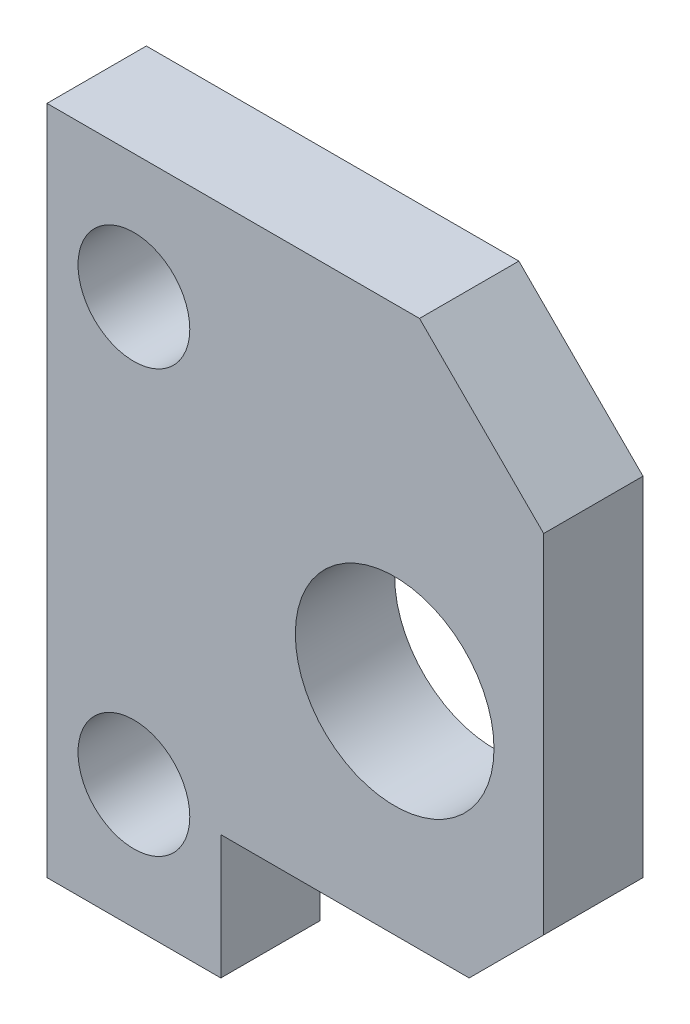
ISO-10303-21;
HEADER;
FILE_DESCRIPTION(('STEP AP214'),'2;1');
FILE_NAME('part.step','',(''),(''),'','','');
FILE_SCHEMA(('AUTOMOTIVE_DESIGN { 1 0 10303 214 1 1 1 1 }'));
ENDSEC;
DATA;
#1=APPLICATION_CONTEXT('core data for automotive mechanical design processes');
#2=APPLICATION_PROTOCOL_DEFINITION('international standard','automotive_design',2000,#1);
#3=PRODUCT_CONTEXT('',#1,'mechanical');
#4=PRODUCT('Part','Part','',(#3));
#5=PRODUCT_RELATED_PRODUCT_CATEGORY('part','',(#4));
#6=PRODUCT_DEFINITION_FORMATION('','',#4);
#7=PRODUCT_DEFINITION_CONTEXT('part definition',#1,'design');
#8=PRODUCT_DEFINITION('design','',#6,#7);
#9=PRODUCT_DEFINITION_SHAPE('','',#8);
#10=(LENGTH_UNIT() NAMED_UNIT(*) SI_UNIT(.MILLI.,.METRE.));
#11=(NAMED_UNIT(*) PLANE_ANGLE_UNIT() SI_UNIT($,.RADIAN.));
#12=(NAMED_UNIT(*) SI_UNIT($,.STERADIAN.) SOLID_ANGLE_UNIT());
#13=UNCERTAINTY_MEASURE_WITH_UNIT(LENGTH_MEASURE(1.E-05),#10,'distance_accuracy_value','');
#14=(GEOMETRIC_REPRESENTATION_CONTEXT(3) GLOBAL_UNCERTAINTY_ASSIGNED_CONTEXT((#13)) GLOBAL_UNIT_ASSIGNED_CONTEXT((#10,
#11,#12)) REPRESENTATION_CONTEXT('',''));
#15=CARTESIAN_POINT('',(0.,0.,0.));
#16=DIRECTION('',(0.,0.,1.));
#17=DIRECTION('',(1.,0.,0.));
#18=AXIS2_PLACEMENT_3D('',#15,#16,#17);
#19=CARTESIAN_POINT('',(0.,0.,4.));
#20=DIRECTION('',(0.,0.,1.));
#21=DIRECTION('',(1.,0.,0.));
#22=AXIS2_PLACEMENT_3D('',#19,#20,#21);
#23=PLANE('',#22);
#24=CARTESIAN_POINT('',(-6.5,8.5,4.));
#25=DIRECTION('',(0.,0.,1.));
#26=DIRECTION('',(1.,0.,0.));
#27=AXIS2_PLACEMENT_3D('',#24,#25,#26);
#28=CIRCLE('',#27,2.25);
#29=CARTESIAN_POINT('',(-4.25,8.5,4.));
#30=VERTEX_POINT('',#29);
#31=EDGE_CURVE('E89',#30,#30,#28,.F.);
#32=ORIENTED_EDGE('',*,*,#31,.T.);
#33=EDGE_LOOP('',(#32));
#34=FACE_BOUND('',#33,.T.);
#35=CARTESIAN_POINT('',(-6.5,-8.5,4.));
#36=DIRECTION('',(0.,0.,1.));
#37=DIRECTION('',(1.,0.,0.));
#38=AXIS2_PLACEMENT_3D('',#35,#36,#37);
#39=CIRCLE('',#38,2.25);
#40=CARTESIAN_POINT('',(-4.25,-8.5,4.));
#41=VERTEX_POINT('',#40);
#42=EDGE_CURVE('E114',#41,#41,#39,.F.);
#43=ORIENTED_EDGE('',*,*,#42,.T.);
#44=EDGE_LOOP('',(#43));
#45=FACE_BOUND('',#44,.T.);
#46=CARTESIAN_POINT('',(4.,0.,4.));
#47=DIRECTION('',(0.,0.,1.));
#48=DIRECTION('',(1.,0.,0.));
#49=AXIS2_PLACEMENT_3D('',#46,#47,#48);
#50=CIRCLE('',#49,4.);
#51=CARTESIAN_POINT('',(8.,0.,4.));
#52=VERTEX_POINT('',#51);
#53=EDGE_CURVE('E20',#52,#52,#50,.F.);
#54=ORIENTED_EDGE('',*,*,#53,.T.);
#55=EDGE_LOOP('',(#54));
#56=FACE_BOUND('',#55,.T.);
#57=DIRECTION('',(1.,0.,0.));
#58=VECTOR('',#57,1.);
#59=CARTESIAN_POINT('',(-10.,-13.5,4.));
#60=LINE('',#59,#58);
#61=CARTESIAN_POINT('',(-10.,-13.5,4.));
#62=VERTEX_POINT('',#61);
#63=CARTESIAN_POINT('',(-3.,-13.5,4.));
#64=VERTEX_POINT('',#63);
#65=EDGE_CURVE('E271',#62,#64,#60,.T.);
#66=ORIENTED_EDGE('',*,*,#65,.T.);
#67=DIRECTION('',(0.,-1.,0.));
#68=VECTOR('',#67,1.);
#69=CARTESIAN_POINT('',(-3.,-8.5,4.));
#70=LINE('',#69,#68);
#71=CARTESIAN_POINT('',(-3.,-8.5,4.));
#72=VERTEX_POINT('',#71);
#73=EDGE_CURVE('E279',#64,#72,#70,.F.);
#74=ORIENTED_EDGE('',*,*,#73,.T.);
#75=DIRECTION('',(-1.,0.,0.));
#76=VECTOR('',#75,1.);
#77=CARTESIAN_POINT('',(10.,-8.5,4.));
#78=LINE('',#77,#76);
#79=CARTESIAN_POINT('',(6.99999999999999,-8.5,4.));
#80=VERTEX_POINT('',#79);
#81=EDGE_CURVE('E284',#72,#80,#78,.F.);
#82=ORIENTED_EDGE('',*,*,#81,.T.);
#83=DIRECTION('',(-0.707106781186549,-0.707106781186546,0.));
#84=VECTOR('',#83,1.);
#85=CARTESIAN_POINT('',(10.,-5.5,4.));
#86=LINE('',#85,#84);
#87=CARTESIAN_POINT('',(10.,-5.5,4.));
#88=VERTEX_POINT('',#87);
#89=EDGE_CURVE('E289',#80,#88,#86,.F.);
#90=ORIENTED_EDGE('',*,*,#89,.T.);
#91=DIRECTION('',(0.,-1.,0.));
#92=VECTOR('',#91,1.);
#93=CARTESIAN_POINT('',(10.,13.5,4.));
#94=LINE('',#93,#92);
#95=CARTESIAN_POINT('',(10.,8.49999999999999,4.));
#96=VERTEX_POINT('',#95);
#97=EDGE_CURVE('E83',#88,#96,#94,.F.);
#98=ORIENTED_EDGE('',*,*,#97,.T.);
#99=DIRECTION('',(0.707106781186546,-0.707106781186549,0.));
#100=VECTOR('',#99,1.);
#101=CARTESIAN_POINT('',(5.,13.5,4.));
#102=LINE('',#101,#100);
#103=CARTESIAN_POINT('',(5.,13.5,4.));
#104=VERTEX_POINT('',#103);
#105=EDGE_CURVE('E82',#96,#104,#102,.F.);
#106=ORIENTED_EDGE('',*,*,#105,.T.);
#107=DIRECTION('',(1.,0.,0.));
#108=VECTOR('',#107,1.);
#109=CARTESIAN_POINT('',(-10.,13.5,4.));
#110=LINE('',#109,#108);
#111=CARTESIAN_POINT('',(-10.,13.5,4.));
#112=VERTEX_POINT('',#111);
#113=EDGE_CURVE('E79',#104,#112,#110,.F.);
#114=ORIENTED_EDGE('',*,*,#113,.T.);
#115=DIRECTION('',(0.,1.,0.));
#116=VECTOR('',#115,1.);
#117=CARTESIAN_POINT('',(-10.,13.5,4.));
#118=LINE('',#117,#116);
#119=EDGE_CURVE('E265',#112,#62,#118,.F.);
#120=ORIENTED_EDGE('',*,*,#119,.T.);
#121=EDGE_LOOP('',(#66,#74,#82,#90,#98,#106,#114,#120));
#122=FACE_BOUND('',#121,.T.);
#123=ADVANCED_FACE('F17',(#34,#45,#56,#122),#23,.T.);
#124=CARTESIAN_POINT('',(4.,0.,0.));
#125=DIRECTION('',(0.,0.,1.));
#126=DIRECTION('',(1.,0.,0.));
#127=AXIS2_PLACEMENT_3D('',#124,#125,#126);
#128=CYLINDRICAL_SURFACE('',#127,4.);
#129=CARTESIAN_POINT('',(4.,0.,0.));
#130=DIRECTION('',(0.,0.,1.));
#131=DIRECTION('',(1.,0.,0.));
#132=AXIS2_PLACEMENT_3D('',#129,#130,#131);
#133=CIRCLE('',#132,4.);
#134=CARTESIAN_POINT('',(8.,0.,0.));
#135=VERTEX_POINT('',#134);
#136=EDGE_CURVE('E110',#135,#135,#133,.F.);
#137=ORIENTED_EDGE('',*,*,#136,.T.);
#138=EDGE_LOOP('',(#137));
#139=FACE_BOUND('',#138,.T.);
#140=ORIENTED_EDGE('',*,*,#53,.F.);
#141=EDGE_LOOP('',(#140));
#142=FACE_BOUND('',#141,.T.);
#143=ADVANCED_FACE('F122',(#139,#142),#128,.F.);
#144=CARTESIAN_POINT('',(-6.5,-8.5,0.));
#145=DIRECTION('',(0.,0.,1.));
#146=DIRECTION('',(1.,0.,0.));
#147=AXIS2_PLACEMENT_3D('',#144,#145,#146);
#148=CYLINDRICAL_SURFACE('',#147,2.25);
#149=CARTESIAN_POINT('',(-6.5,-8.5,0.));
#150=DIRECTION('',(0.,0.,1.));
#151=DIRECTION('',(1.,0.,0.));
#152=AXIS2_PLACEMENT_3D('',#149,#150,#151);
#153=CIRCLE('',#152,2.25);
#154=CARTESIAN_POINT('',(-4.25,-8.5,0.));
#155=VERTEX_POINT('',#154);
#156=EDGE_CURVE('E107',#155,#155,#153,.F.);
#157=ORIENTED_EDGE('',*,*,#156,.T.);
#158=EDGE_LOOP('',(#157));
#159=FACE_BOUND('',#158,.T.);
#160=ORIENTED_EDGE('',*,*,#42,.F.);
#161=EDGE_LOOP('',(#160));
#162=FACE_BOUND('',#161,.T.);
#163=ADVANCED_FACE('F124',(#159,#162),#148,.F.);
#164=CARTESIAN_POINT('',(-6.5,8.5,0.));
#165=DIRECTION('',(0.,0.,1.));
#166=DIRECTION('',(1.,0.,0.));
#167=AXIS2_PLACEMENT_3D('',#164,#165,#166);
#168=CYLINDRICAL_SURFACE('',#167,2.25);
#169=CARTESIAN_POINT('',(-6.5,8.5,0.));
#170=DIRECTION('',(0.,0.,1.));
#171=DIRECTION('',(1.,0.,0.));
#172=AXIS2_PLACEMENT_3D('',#169,#170,#171);
#173=CIRCLE('',#172,2.25);
#174=CARTESIAN_POINT('',(-4.25,8.5,0.));
#175=VERTEX_POINT('',#174);
#176=EDGE_CURVE('E104',#175,#175,#173,.F.);
#177=ORIENTED_EDGE('',*,*,#176,.T.);
#178=EDGE_LOOP('',(#177));
#179=FACE_BOUND('',#178,.T.);
#180=ORIENTED_EDGE('',*,*,#31,.F.);
#181=EDGE_LOOP('',(#180));
#182=FACE_BOUND('',#181,.T.);
#183=ADVANCED_FACE('F131',(#179,#182),#168,.F.);
#184=CARTESIAN_POINT('',(5.,13.5,4.));
#185=DIRECTION('',(-0.707106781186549,-0.707106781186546,0.));
#186=DIRECTION('',(0.707106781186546,-0.707106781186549,0.));
#187=AXIS2_PLACEMENT_3D('',#184,#185,#186);
#188=PLANE('',#187);
#189=DIRECTION('',(0.,0.,1.));
#190=VECTOR('',#189,1.);
#191=CARTESIAN_POINT('',(10.,8.49999999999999,4.));
#192=LINE('',#191,#190);
#193=CARTESIAN_POINT('',(10.,8.49999999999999,0.));
#194=VERTEX_POINT('',#193);
#195=EDGE_CURVE('E291',#96,#194,#192,.F.);
#196=ORIENTED_EDGE('',*,*,#195,.T.);
#197=DIRECTION('',(-0.707106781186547,0.707106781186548,0.));
#198=VECTOR('',#197,1.);
#199=CARTESIAN_POINT('',(10.,8.49999999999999,0.));
#200=LINE('',#199,#198);
#201=CARTESIAN_POINT('',(5.,13.5,0.));
#202=VERTEX_POINT('',#201);
#203=EDGE_CURVE('E100',#194,#202,#200,.T.);
#204=ORIENTED_EDGE('',*,*,#203,.T.);
#205=DIRECTION('',(0.,0.,-1.));
#206=VECTOR('',#205,1.);
#207=CARTESIAN_POINT('',(5.,13.5,4.));
#208=LINE('',#207,#206);
#209=EDGE_CURVE('E88',#202,#104,#208,.F.);
#210=ORIENTED_EDGE('',*,*,#209,.T.);
#211=ORIENTED_EDGE('',*,*,#105,.F.);
#212=EDGE_LOOP('',(#196,#204,#210,#211));
#213=FACE_BOUND('',#212,.T.);
#214=ADVANCED_FACE('F99',(#213),#188,.F.);
#215=CARTESIAN_POINT('',(-10.,13.5,4.));
#216=DIRECTION('',(0.,-1.,0.));
#217=DIRECTION('',(0.,0.,-1.));
#218=AXIS2_PLACEMENT_3D('',#215,#216,#217);
#219=PLANE('',#218);
#220=ORIENTED_EDGE('',*,*,#209,.F.);
#221=DIRECTION('',(1.,0.,0.));
#222=VECTOR('',#221,1.);
#223=CARTESIAN_POINT('',(0.,13.5,0.));
#224=LINE('',#223,#222);
#225=CARTESIAN_POINT('',(-10.,13.5,0.));
#226=VERTEX_POINT('',#225);
#227=EDGE_CURVE('E296',#202,#226,#224,.F.);
#228=ORIENTED_EDGE('',*,*,#227,.T.);
#229=DIRECTION('',(0.,0.,1.));
#230=VECTOR('',#229,1.);
#231=CARTESIAN_POINT('',(-10.,13.5,4.));
#232=LINE('',#231,#230);
#233=EDGE_CURVE('E96',#226,#112,#232,.T.);
#234=ORIENTED_EDGE('',*,*,#233,.T.);
#235=ORIENTED_EDGE('',*,*,#113,.F.);
#236=EDGE_LOOP('',(#220,#228,#234,#235));
#237=FACE_BOUND('',#236,.T.);
#238=ADVANCED_FACE('F93',(#237),#219,.F.);
#239=CARTESIAN_POINT('',(-10.,13.5,4.));
#240=DIRECTION('',(1.,0.,0.));
#241=DIRECTION('',(0.,1.,0.));
#242=AXIS2_PLACEMENT_3D('',#239,#240,#241);
#243=PLANE('',#242);
#244=DIRECTION('',(0.,0.,1.));
#245=VECTOR('',#244,1.);
#246=CARTESIAN_POINT('',(-10.,-13.5,4.));
#247=LINE('',#246,#245);
#248=CARTESIAN_POINT('',(-10.,-13.5,0.));
#249=VERTEX_POINT('',#248);
#250=EDGE_CURVE('E264',#249,#62,#247,.T.);
#251=ORIENTED_EDGE('',*,*,#250,.T.);
#252=ORIENTED_EDGE('',*,*,#119,.F.);
#253=ORIENTED_EDGE('',*,*,#233,.F.);
#254=DIRECTION('',(0.,1.,0.));
#255=VECTOR('',#254,1.);
#256=CARTESIAN_POINT('',(-10.,0.,0.));
#257=LINE('',#256,#255);
#258=EDGE_CURVE('E267',#226,#249,#257,.F.);
#259=ORIENTED_EDGE('',*,*,#258,.T.);
#260=EDGE_LOOP('',(#251,#252,#253,#259));
#261=FACE_BOUND('',#260,.T.);
#262=ADVANCED_FACE('F162',(#261),#243,.F.);
#263=CARTESIAN_POINT('',(-10.,-13.5,4.));
#264=DIRECTION('',(0.,1.,0.));
#265=DIRECTION('',(0.,0.,1.));
#266=AXIS2_PLACEMENT_3D('',#263,#264,#265);
#267=PLANE('',#266);
#268=DIRECTION('',(0.,0.,1.));
#269=VECTOR('',#268,1.);
#270=CARTESIAN_POINT('',(-3.,-13.5,0.));
#271=LINE('',#270,#269);
#272=CARTESIAN_POINT('',(-3.,-13.5,0.));
#273=VERTEX_POINT('',#272);
#274=EDGE_CURVE('E273',#273,#64,#271,.T.);
#275=ORIENTED_EDGE('',*,*,#274,.T.);
#276=ORIENTED_EDGE('',*,*,#65,.F.);
#277=ORIENTED_EDGE('',*,*,#250,.F.);
#278=DIRECTION('',(1.,0.,0.));
#279=VECTOR('',#278,1.);
#280=CARTESIAN_POINT('',(0.,-13.5,0.));
#281=LINE('',#280,#279);
#282=EDGE_CURVE('E299',#249,#273,#281,.T.);
#283=ORIENTED_EDGE('',*,*,#282,.T.);
#284=EDGE_LOOP('',(#275,#276,#277,#283));
#285=FACE_BOUND('',#284,.T.);
#286=ADVANCED_FACE('F158',(#285),#267,.F.);
#287=CARTESIAN_POINT('',(-3.,-8.5,0.));
#288=DIRECTION('',(-1.,0.,0.));
#289=DIRECTION('',(0.,-1.,0.));
#290=AXIS2_PLACEMENT_3D('',#287,#288,#289);
#291=PLANE('',#290);
#292=ORIENTED_EDGE('',*,*,#274,.F.);
#293=DIRECTION('',(0.,1.,0.));
#294=VECTOR('',#293,1.);
#295=CARTESIAN_POINT('',(-3.,0.,0.));
#296=LINE('',#295,#294);
#297=CARTESIAN_POINT('',(-3.,-8.5,0.));
#298=VERTEX_POINT('',#297);
#299=EDGE_CURVE('E301',#273,#298,#296,.T.);
#300=ORIENTED_EDGE('',*,*,#299,.T.);
#301=DIRECTION('',(0.,0.,1.));
#302=VECTOR('',#301,1.);
#303=CARTESIAN_POINT('',(-3.,-8.5,0.));
#304=LINE('',#303,#302);
#305=EDGE_CURVE('E281',#298,#72,#304,.T.);
#306=ORIENTED_EDGE('',*,*,#305,.T.);
#307=ORIENTED_EDGE('',*,*,#73,.F.);
#308=EDGE_LOOP('',(#292,#300,#306,#307));
#309=FACE_BOUND('',#308,.T.);
#310=ADVANCED_FACE('F154',(#309),#291,.F.);
#311=CARTESIAN_POINT('',(10.,-8.5,0.));
#312=DIRECTION('',(0.,1.,0.));
#313=DIRECTION('',(-1.,0.,0.));
#314=AXIS2_PLACEMENT_3D('',#311,#312,#313);
#315=PLANE('',#314);
#316=DIRECTION('',(0.,0.,1.));
#317=VECTOR('',#316,1.);
#318=CARTESIAN_POINT('',(6.99999999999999,-8.5,4.));
#319=LINE('',#318,#317);
#320=CARTESIAN_POINT('',(6.99999999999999,-8.5,0.));
#321=VERTEX_POINT('',#320);
#322=EDGE_CURVE('E286',#321,#80,#319,.T.);
#323=ORIENTED_EDGE('',*,*,#322,.T.);
#324=ORIENTED_EDGE('',*,*,#81,.F.);
#325=ORIENTED_EDGE('',*,*,#305,.F.);
#326=DIRECTION('',(1.,0.,0.));
#327=VECTOR('',#326,1.);
#328=CARTESIAN_POINT('',(0.,-8.5,0.));
#329=LINE('',#328,#327);
#330=EDGE_CURVE('E304',#298,#321,#329,.T.);
#331=ORIENTED_EDGE('',*,*,#330,.T.);
#332=EDGE_LOOP('',(#323,#324,#325,#331));
#333=FACE_BOUND('',#332,.T.);
#334=ADVANCED_FACE('F150',(#333),#315,.F.);
#335=CARTESIAN_POINT('',(10.,-5.5,4.));
#336=DIRECTION('',(-0.707106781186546,0.707106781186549,0.));
#337=DIRECTION('',(-0.707106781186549,-0.707106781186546,0.));
#338=AXIS2_PLACEMENT_3D('',#335,#336,#337);
#339=PLANE('',#338);
#340=ORIENTED_EDGE('',*,*,#322,.F.);
#341=DIRECTION('',(0.707106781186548,0.707106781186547,0.));
#342=VECTOR('',#341,1.);
#343=CARTESIAN_POINT('',(6.99999999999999,-8.5,0.));
#344=LINE('',#343,#342);
#345=CARTESIAN_POINT('',(10.,-5.5,0.));
#346=VERTEX_POINT('',#345);
#347=EDGE_CURVE('E26',#321,#346,#344,.T.);
#348=ORIENTED_EDGE('',*,*,#347,.T.);
#349=DIRECTION('',(0.,0.,1.));
#350=VECTOR('',#349,1.);
#351=CARTESIAN_POINT('',(10.,-5.5,4.));
#352=LINE('',#351,#350);
#353=EDGE_CURVE('E34',#346,#88,#352,.T.);
#354=ORIENTED_EDGE('',*,*,#353,.T.);
#355=ORIENTED_EDGE('',*,*,#89,.F.);
#356=EDGE_LOOP('',(#340,#348,#354,#355));
#357=FACE_BOUND('',#356,.T.);
#358=ADVANCED_FACE('F143',(#357),#339,.F.);
#359=CARTESIAN_POINT('',(10.,13.5,4.));
#360=DIRECTION('',(-1.,0.,0.));
#361=DIRECTION('',(0.,-1.,0.));
#362=AXIS2_PLACEMENT_3D('',#359,#360,#361);
#363=PLANE('',#362);
#364=ORIENTED_EDGE('',*,*,#353,.F.);
#365=DIRECTION('',(0.,1.,0.));
#366=VECTOR('',#365,1.);
#367=CARTESIAN_POINT('',(10.,0.,0.));
#368=LINE('',#367,#366);
#369=EDGE_CURVE('E11',#346,#194,#368,.T.);
#370=ORIENTED_EDGE('',*,*,#369,.T.);
#371=ORIENTED_EDGE('',*,*,#195,.F.);
#372=ORIENTED_EDGE('',*,*,#97,.F.);
#373=EDGE_LOOP('',(#364,#370,#371,#372));
#374=FACE_BOUND('',#373,.T.);
#375=ADVANCED_FACE('F137',(#374),#363,.F.);
#376=CARTESIAN_POINT('',(0.,0.,0.));
#377=DIRECTION('',(0.,0.,1.));
#378=DIRECTION('',(1.,0.,0.));
#379=AXIS2_PLACEMENT_3D('',#376,#377,#378);
#380=PLANE('',#379);
#381=ORIENTED_EDGE('',*,*,#347,.F.);
#382=ORIENTED_EDGE('',*,*,#330,.F.);
#383=ORIENTED_EDGE('',*,*,#299,.F.);
#384=ORIENTED_EDGE('',*,*,#282,.F.);
#385=ORIENTED_EDGE('',*,*,#258,.F.);
#386=ORIENTED_EDGE('',*,*,#227,.F.);
#387=ORIENTED_EDGE('',*,*,#203,.F.);
#388=ORIENTED_EDGE('',*,*,#369,.F.);
#389=EDGE_LOOP('',(#381,#382,#383,#384,#385,#386,#387,#388));
#390=FACE_BOUND('',#389,.T.);
#391=ORIENTED_EDGE('',*,*,#176,.F.);
#392=EDGE_LOOP('',(#391));
#393=FACE_BOUND('',#392,.T.);
#394=ORIENTED_EDGE('',*,*,#156,.F.);
#395=EDGE_LOOP('',(#394));
#396=FACE_BOUND('',#395,.T.);
#397=ORIENTED_EDGE('',*,*,#136,.F.);
#398=EDGE_LOOP('',(#397));
#399=FACE_BOUND('',#398,.T.);
#400=ADVANCED_FACE('F135',(#390,#393,#396,#399),#380,.F.);
#401=CLOSED_SHELL('',(#123,#143,#163,#183,#214,#238,#262,#286,#310,#334,#358,#375,#400));
#402=MANIFOLD_SOLID_BREP('B1',#401);
#403=ADVANCED_BREP_SHAPE_REPRESENTATION('',(#18,#402),#14);
#404=SHAPE_DEFINITION_REPRESENTATION(#9,#403);
ENDSEC;
END-ISO-10303-21;
